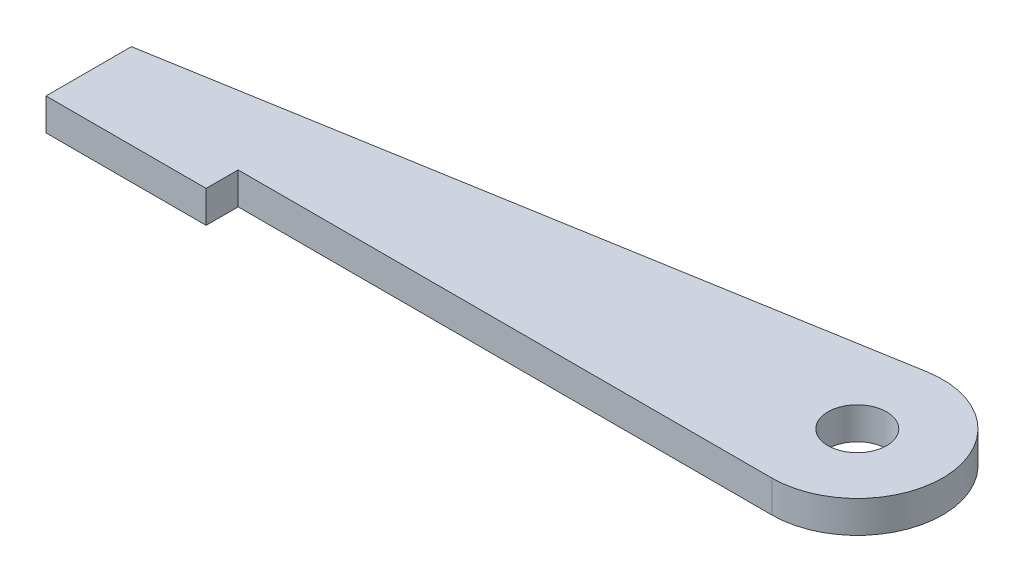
from build123d import *

# Parameters (mm, degrees)
SKETCH1_R      = 2.75
EXTRUDE1_DEPTH = 3


with BuildPart() as part:
    # Sketch1 → Extrude1 (new body)
    with BuildSketch(Plane(origin=(0, 0, 0), x_dir=(1, 0, 0), z_dir=(0, 1, 0))):
        with BuildLine():
            Line((0, 0), (0, -8))
            Line((0, -8), (15, -8))
            Line((15, -8), (15, -5))
            Line((15, -5), (65, -5))
            ThreePointArc((65, -5), (72.97132789, 3.676706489), (63.651437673, 10.885517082))
            Line((63.651437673, 10.885517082), (0, 0))
        make_face()
        with Locations(Location((65, 3, 0), (0, 0, 270))):
            Circle(SKETCH1_R, mode=Mode.SUBTRACT)
    extrude(amount=EXTRUDE1_DEPTH)


solid = part.part
